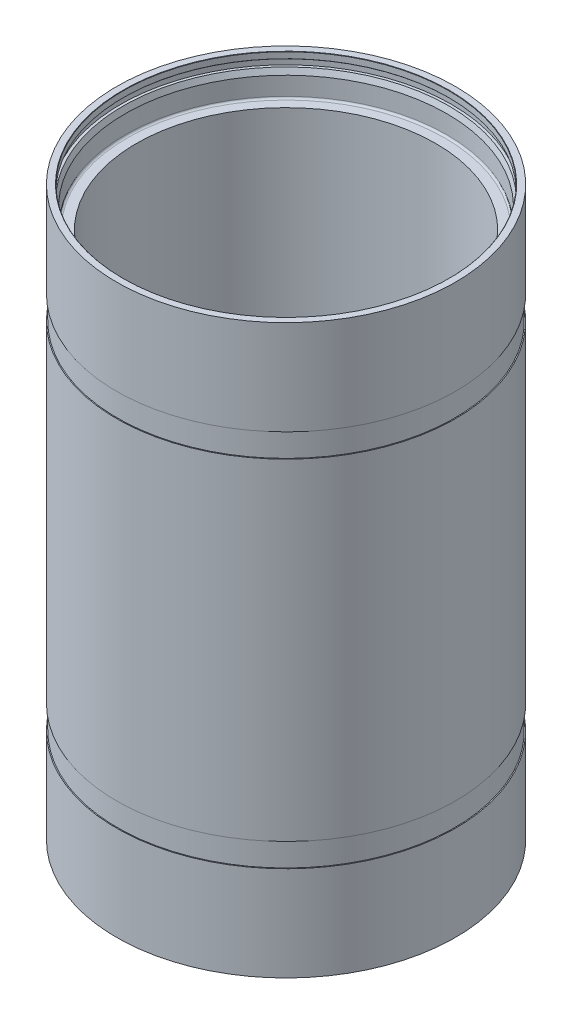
from build123d import *

# Parameters (mm, degrees)
FILLET1_R                = 1.524
CHAMFER1_SIZE            = 0.254
FILLET1_OF_MIRROR1_R     = 1.524
CHAMFER1_OF_MIRROR1_SIZE = 0.254


with BuildPart() as part:
    # Sketch7 → Revolve1 (revolve)
    with BuildSketch(Plane.XY, mode=Mode.PRIVATE) as revolve1_sk:
        Polygon((-136.525, 228.6), (-136.525, 152.4), (-135.763, 152.4), (-135.763, 133.35), (-136.525, 133.35), (-136.525, 0), (-120.5611, 0), (-120.5611, 196.85), (-129.5654, 196.85), (-129.5654, 213.106), (-131.229471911, 217.678), (-133.35, 217.678), (-133.35, 223.266), (-131.1275, 223.266), (-131.1275, 228.6), align=None)
    revolve1 = revolve(revolve1_sk.sketch.rotate(Axis((0, 0, 0), (0, 1, 0)), 270), axis=Axis((0, 0, 0), (0, 1, 0)))

    # Fillet1
    fillet1_edges = [part.edges().sort_by_distance(p)[0] for p in [
        (0, 196.85, 129.5654),
    ]]
    fillet(fillet1_edges, radius=FILLET1_R)

    # Chamfer1
    chamfer1_edges = [part.edges().sort_by_distance(p)[0] for p in [
        (0, 228.6, 131.1275),
        (0, 223.266, 131.1275),
    ]]
    chamfer(chamfer1_edges, length=CHAMFER1_SIZE)


with BuildPart() as mirror1_1:
    # Mirror1: Revolve1 across Top Plane
    add(revolve1.mirror(Plane(origin=(0, 0, 0), x_dir=(1, 0, 0), z_dir=(0, 1, 0))))

    # Fillet1 of Mirror1
    fillet1_of_mirror1_edges = [mirror1_1.edges().sort_by_distance(p)[0] for p in [
        (0, -196.85, 129.5654),
    ]]
    fillet(fillet1_of_mirror1_edges, radius=FILLET1_OF_MIRROR1_R)

    # Chamfer1 of Mirror1
    chamfer1_of_mirror1_edges = [mirror1_1.edges().sort_by_distance(p)[0] for p in [
        (0, -228.6, 131.1275),
        (0, -223.266, 131.1275),
    ]]
    chamfer(chamfer1_of_mirror1_edges, length=CHAMFER1_OF_MIRROR1_SIZE)


with BuildPart() as part_1:
    add(part.part)

    # Mirror1 united with what the copies touc: union Mirror1_1
    add(mirror1_1.part)


solid = part_1.part
